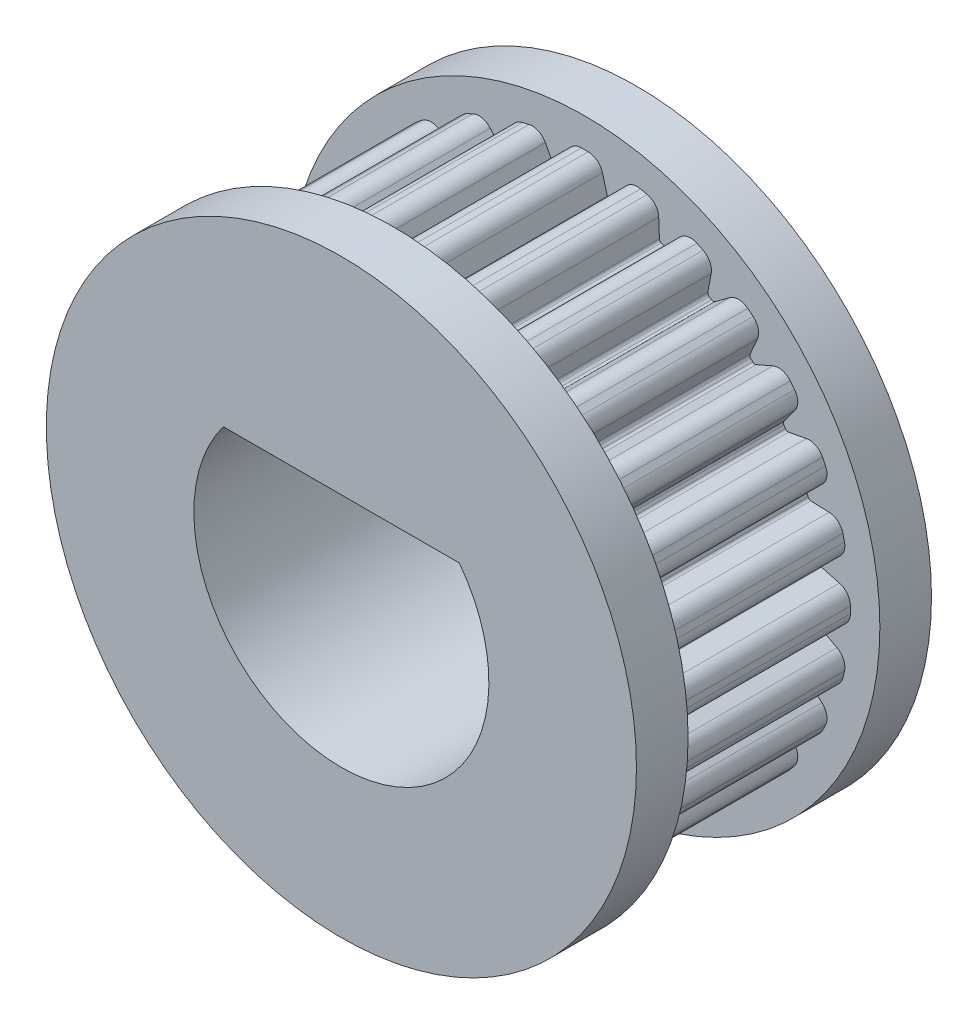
from build123d import *

# Parameters (mm, degrees)
CROQUIS1_R              = 10
SALIENTE_EXTRUIR1_DEPTH = 10
CORTAR_EXTRUIR1_START   = -1.75
CROQUIS2_R              = 12
CROQUIS2_R_2            = 8
CORTAR_EXTRUIR1_DEPTH   = 6.5
SALIENTE_EXTRUIR2_DEPTH = 6.5
REDONDEO1_R             = 0.5
REDONDEO2_R             = 0.1
MATRIZC1_COUNT          = 28
REDONDEO1_OF_MATRIZC1_R = 0.5
REDONDEO2_OF_MATRIZC1_R = 0.1


with BuildPart() as part:
    # Croquis1 → Saliente-Extruir1 (new body)
    with BuildSketch(Plane.XY):
        Circle(CROQUIS1_R)
        with BuildLine():
            Line((4, 3), (-4, 3))
            ThreePointArc((-4, 3), (0, -5), (4, 3))
        make_face(mode=Mode.SUBTRACT)
    extrude(amount=SALIENTE_EXTRUIR1_DEPTH)

    # Croquis2 → Cortar-Extruir1 (cut)
    with BuildSketch(Plane.XY.offset(10).offset(CORTAR_EXTRUIR1_START)):
        Circle(CROQUIS2_R)
        Circle(CROQUIS2_R_2, mode=Mode.SUBTRACT)
    extrude(amount=-CORTAR_EXTRUIR1_DEPTH, mode=Mode.SUBTRACT)

    # Croquis3 → Saliente-Extruir2 (add)
    with BuildSketch(Plane.XY.offset(1.75)):
        Polygon((-0.5, 9), (-1.035898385, 7), (1.035898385, 7), (0.5, 9), align=None)
    saliente_extruir2 = extrude(amount=SALIENTE_EXTRUIR2_DEPTH)

    # Redondeo1
    redondeo1_edges = [part.edges().sort_by_distance(p)[0] for p in [
        (0.5, 9, 5),
        (-0.5, 9, 5),
    ]]
    fillet(redondeo1_edges, radius=REDONDEO1_R)

    # Redondeo2
    redondeo2_edges = [part.edges().sort_by_distance(p)[0] for p in [
        (0.778112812, 7.962068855, 5),
        (-0.778112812, 7.962068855, 5),
    ]]
    fillet(redondeo2_edges, radius=REDONDEO2_R)

    # MatrizC1: Saliente-Extruir2 ×28 about axis
    matrizc1_axis = Axis((0, 0, 0), (0, 0, 1))
    for i in range(1, MATRIZC1_COUNT):
        add(saliente_extruir2.rotate(matrizc1_axis, i * 360 / MATRIZC1_COUNT))

    # Redondeo1 of MatrizC1
    redondeo1_of_matrizc1_edges = [part.edges().sort_by_distance(p)[0] for p in [
        (-1.51522445, 8.885611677, 5),
        (-2.490152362, 8.663090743, 5),
        (-3.454469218, 8.325661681, 5),
        (-4.355438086, 7.891777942, 5),
        (-5.220492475, 7.348228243, 5),
        (-6.002323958, 6.724738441, 5),
        (-6.724738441, 6.002323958, 5),
        (-7.348228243, 5.220492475, 5),
        (-7.891777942, 4.355438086, 5),
        (-8.325661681, 3.454469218, 5),
        (-8.663090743, 2.490152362, 5),
        (-8.885611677, 1.51522445, 5),
        (-9, 0.5, 5),
        (-9, -0.5, 5),
        (-8.885611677, -1.51522445, 5),
        (-8.663090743, -2.490152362, 5),
        (-8.325661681, -3.454469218, 5),
        (-7.891777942, -4.355438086, 5),
        (-7.348228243, -5.220492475, 5),
        (-6.724738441, -6.002323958, 5),
        (-6.002323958, -6.724738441, 5),
        (-5.220492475, -7.348228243, 5),
        (-4.355438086, -7.891777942, 5),
        (-3.454469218, -8.325661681, 5),
        (-2.490152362, -8.663090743, 5),
        (-1.51522445, -8.885611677, 5),
        (-0.5, -9, 5),
        (0.5, -9, 5),
        (1.51522445, -8.885611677, 5),
        (2.490152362, -8.663090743, 5),
        (3.454469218, -8.325661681, 5),
        (4.355438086, -7.891777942, 5),
        (5.220492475, -7.348228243, 5),
        (6.002323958, -6.724738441, 5),
        (6.724738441, -6.002323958, 5),
        (7.348228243, -5.220492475, 5),
        (7.891777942, -4.355438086, 5),
        (8.325661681, -3.454469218, 5),
        (8.663090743, -2.490152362, 5),
        (8.885611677, -1.51522445, 5),
        (9, -0.5, 5),
        (9, 0.5, 5),
        (8.885611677, 1.51522445, 5),
        (8.663090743, 2.490152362, 5),
        (8.325661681, 3.454469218, 5),
        (7.891777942, 4.355438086, 5),
        (7.348228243, 5.220492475, 5),
        (6.724738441, 6.002323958, 5),
        (6.002323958, 6.724738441, 5),
        (5.220492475, 7.348228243, 5),
        (4.355438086, 7.891777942, 5),
        (3.454469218, 8.325661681, 5),
        (2.490152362, 8.663090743, 5),
        (1.51522445, 8.885611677, 5),
    ]]
    fillet(redondeo1_of_matrizc1_edges, radius=REDONDEO1_OF_MATRIZC1_R)

    # Redondeo2 of MatrizC1
    redondeo2_of_matrizc1_edges = [part.edges().sort_by_distance(p)[0] for p in [
        (-1.013123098, 7.935589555, 5),
        (-2.530330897, 7.589296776, 5),
        (-2.753556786, 7.511186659, 5),
        (-4.155667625, 6.835965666, 5),
        (-4.355915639, 6.710141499, 5),
        (-5.572621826, 5.739850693, 5),
        (-5.739850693, 5.572621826, 5),
        (-6.710141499, 4.355915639, 5),
        (-6.835965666, 4.155667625, 5),
        (-7.511186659, 2.753556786, 5),
        (-7.589296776, 2.530330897, 5),
        (-7.935589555, 1.013123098, 5),
        (-7.962068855, 0.778112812, 5),
        (-7.962068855, -0.778112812, 5),
        (-7.935589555, -1.013123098, 5),
        (-7.589296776, -2.530330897, 5),
        (-7.511186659, -2.753556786, 5),
        (-6.835965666, -4.155667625, 5),
        (-6.710141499, -4.355915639, 5),
        (-5.739850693, -5.572621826, 5),
        (-5.572621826, -5.739850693, 5),
        (-4.355915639, -6.710141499, 5),
        (-4.155667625, -6.835965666, 5),
        (-2.753556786, -7.511186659, 5),
        (-2.530330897, -7.589296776, 5),
        (-1.013123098, -7.935589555, 5),
        (-0.778112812, -7.962068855, 5),
        (0.778112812, -7.962068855, 5),
        (1.013123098, -7.935589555, 5),
        (2.530330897, -7.589296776, 5),
        (2.753556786, -7.511186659, 5),
        (4.155667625, -6.835965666, 5),
        (4.355915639, -6.710141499, 5),
        (5.572621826, -5.739850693, 5),
        (5.739850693, -5.572621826, 5),
        (6.710141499, -4.355915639, 5),
        (6.835965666, -4.155667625, 5),
        (7.511186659, -2.753556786, 5),
        (7.589296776, -2.530330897, 5),
        (7.935589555, -1.013123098, 5),
        (7.962068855, -0.778112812, 5),
        (7.962068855, 0.778112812, 5),
        (7.935589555, 1.013123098, 5),
        (7.589296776, 2.530330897, 5),
        (7.511186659, 2.753556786, 5),
        (6.835965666, 4.155667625, 5),
        (6.710141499, 4.355915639, 5),
        (5.739850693, 5.572621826, 5),
        (5.572621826, 5.739850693, 5),
        (4.355915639, 6.710141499, 5),
        (4.155667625, 6.835965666, 5),
        (2.753556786, 7.511186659, 5),
        (2.530330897, 7.589296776, 5),
        (1.013123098, 7.935589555, 5),
    ]]
    fillet(redondeo2_of_matrizc1_edges, radius=REDONDEO2_OF_MATRIZC1_R)


solid = part.part
